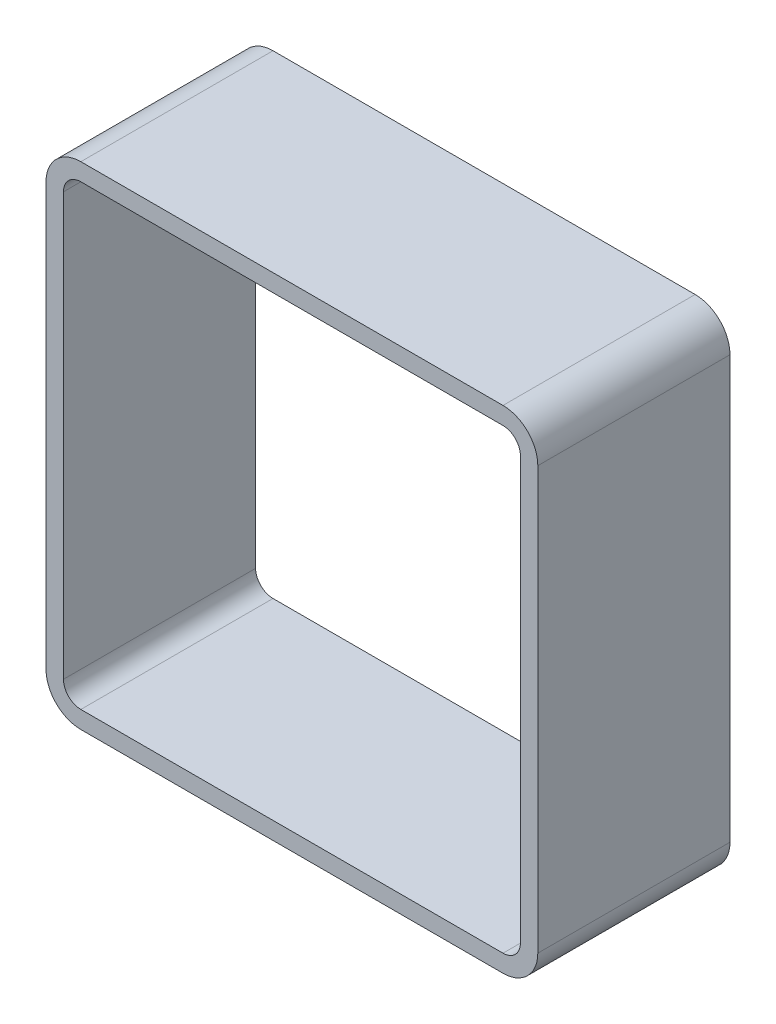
from build123d import *

# Parameters (mm, degrees)
BASESECTION_DEPTH = 12.7


with BuildPart() as part:
    # Sketch1 → BaseSection (new, symmetric)
    with BuildSketch(Plane.XY):
        with BuildLine():
            Line((-27.9, -32.5), (27.9, -32.5))
            ThreePointArc((27.9, -32.5), (31.152691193, -31.152691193), (32.5, -27.9))
            Line((32.5, -27.9), (32.5, 27.9))
            ThreePointArc((32.5, 27.9), (31.152691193, 31.152691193), (27.9, 32.5))
            Line((27.9, 32.5), (-27.9, 32.5))
            ThreePointArc((-27.9, 32.5), (-31.152691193, 31.152691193), (-32.5, 27.9))
            Line((-32.5, 27.9), (-32.5, -27.9))
            ThreePointArc((-32.5, -27.9), (-31.152691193, -31.152691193), (-27.9, -32.5))
        make_face()
        with BuildLine():
            Line((-27.9, 30.2), (27.9, 30.2))
            ThreePointArc((27.9, 30.2), (29.526345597, 29.526345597), (30.2, 27.9))
            Line((30.2, 27.9), (30.2, -27.9))
            ThreePointArc((30.2, -27.9), (29.526345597, -29.526345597), (27.9, -30.2))
            Line((27.9, -30.2), (-27.9, -30.2))
            ThreePointArc((-27.9, -30.2), (-29.526345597, -29.526345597), (-30.2, -27.9))
            Line((-30.2, -27.9), (-30.2, 27.9))
            ThreePointArc((-30.2, 27.9), (-29.526345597, 29.526345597), (-27.9, 30.2))
        make_face(mode=Mode.SUBTRACT)
    extrude(amount=BASESECTION_DEPTH, both=True)


solid = part.part
